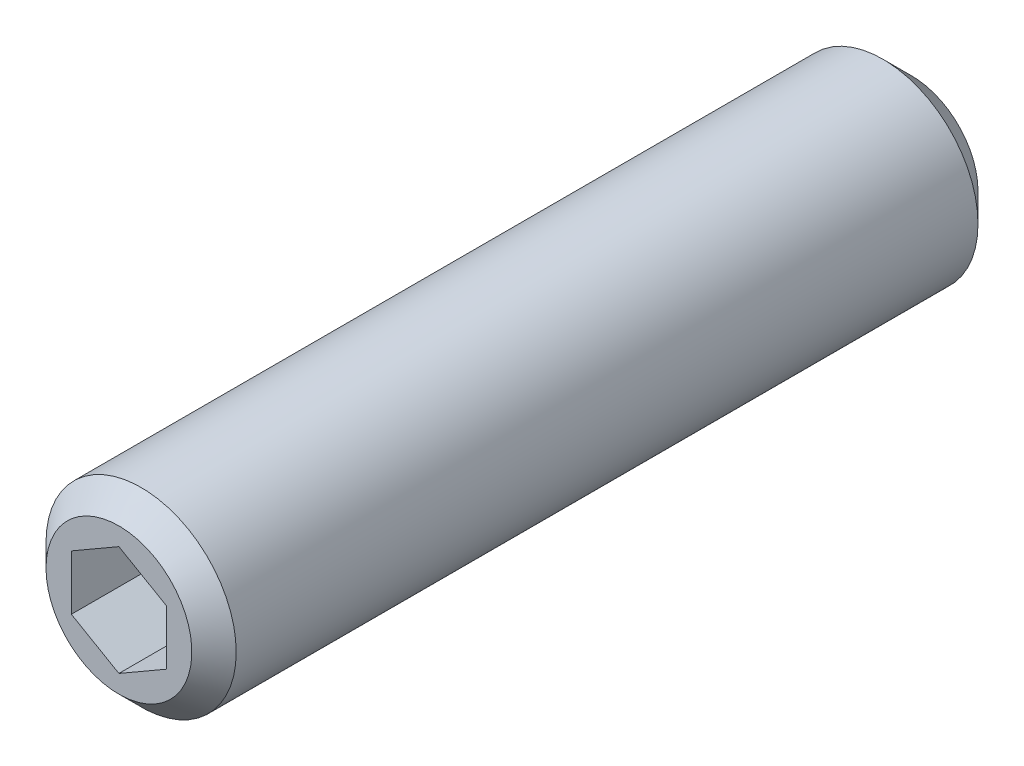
ISO-10303-21;
HEADER;
FILE_DESCRIPTION(('STEP AP214'),'2;1');
FILE_NAME('part.step','',(''),(''),'','','');
FILE_SCHEMA(('AUTOMOTIVE_DESIGN { 1 0 10303 214 1 1 1 1 }'));
ENDSEC;
DATA;
#1=APPLICATION_CONTEXT('core data for automotive mechanical design processes');
#2=APPLICATION_PROTOCOL_DEFINITION('international standard','automotive_design',2000,#1);
#3=PRODUCT_CONTEXT('',#1,'mechanical');
#4=PRODUCT('Part','Part','',(#3));
#5=PRODUCT_RELATED_PRODUCT_CATEGORY('part','',(#4));
#6=PRODUCT_DEFINITION_FORMATION('','',#4);
#7=PRODUCT_DEFINITION_CONTEXT('part definition',#1,'design');
#8=PRODUCT_DEFINITION('design','',#6,#7);
#9=PRODUCT_DEFINITION_SHAPE('','',#8);
#10=(LENGTH_UNIT() NAMED_UNIT(*) SI_UNIT(.MILLI.,.METRE.));
#11=(NAMED_UNIT(*) PLANE_ANGLE_UNIT() SI_UNIT($,.RADIAN.));
#12=(NAMED_UNIT(*) SI_UNIT($,.STERADIAN.) SOLID_ANGLE_UNIT());
#13=UNCERTAINTY_MEASURE_WITH_UNIT(LENGTH_MEASURE(1.E-05),#10,'distance_accuracy_value','');
#14=(GEOMETRIC_REPRESENTATION_CONTEXT(3) GLOBAL_UNCERTAINTY_ASSIGNED_CONTEXT((#13)) GLOBAL_UNIT_ASSIGNED_CONTEXT((#10,
#11,#12)) REPRESENTATION_CONTEXT('',''));
#15=CARTESIAN_POINT('',(0.,0.,0.));
#16=DIRECTION('',(0.,0.,1.));
#17=DIRECTION('',(1.,0.,0.));
#18=AXIS2_PLACEMENT_3D('',#15,#16,#17);
#19=CARTESIAN_POINT('',(-0.740835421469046,-2.76483541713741,25.999999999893));
#20=DIRECTION('',(1.44336692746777E-10,0.,-1.));
#21=DIRECTION('',(-0.499999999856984,0.866025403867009,-7.21667802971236E-11));
#22=AXIS2_PLACEMENT_3D('',#19,#20,#21);
#23=PLANE('',#22);
#24=CARTESIAN_POINT('',(-3.75275401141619E-09,0.,26.));
#25=DIRECTION('',(1.44336692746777E-10,0.,-1.));
#26=DIRECTION('',(-1.,0.,-1.44336692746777E-10));
#27=AXIS2_PLACEMENT_3D('',#24,#25,#26);
#28=CIRCLE('',#27,2.3);
#29=CARTESIAN_POINT('',(-2.30000000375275,0.,25.999999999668));
#30=VERTEX_POINT('',#29);
#31=EDGE_CURVE('E23',#30,#30,#28,.F.);
#32=ORIENTED_EDGE('',*,*,#31,.T.);
#33=EDGE_LOOP('',(#32));
#34=FACE_BOUND('',#33,.T.);
#35=DIRECTION('',(-0.866025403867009,-0.499999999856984,-1.2500014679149E-10));
#36=VECTOR('',#35,1.);
#37=CARTESIAN_POINT('',(0.749999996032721,-1.29903810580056,26.0000000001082));
#38=LINE('',#37,#36);
#39=CARTESIAN_POINT('',(1.49999999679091,-0.86602540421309,26.0000000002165));
#40=VERTEX_POINT('',#39);
#41=CARTESIAN_POINT('',(-3.75275526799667E-09,-1.73205080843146,26.));
#42=VERTEX_POINT('',#41);
#43=EDGE_CURVE('E81',#40,#42,#38,.T.);
#44=ORIENTED_EDGE('',*,*,#43,.T.);
#45=DIRECTION('',(-0.866025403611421,0.500000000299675,-1.24998338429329E-10));
#46=VECTOR('',#45,1.);
#47=CARTESIAN_POINT('',(-0.750000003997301,-1.29903810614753,25.9999999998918));
#48=LINE('',#47,#46);
#49=CARTESIAN_POINT('',(-1.5000000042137,-0.866025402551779,25.9999999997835));
#50=VERTEX_POINT('',#49);
#51=EDGE_CURVE('E110',#42,#50,#48,.T.);
#52=ORIENTED_EDGE('',*,*,#51,.T.);
#53=DIRECTION('',(-1.57536761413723E-11,1.,0.));
#54=VECTOR('',#53,1.);
#55=CARTESIAN_POINT('',(-1.50000000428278,5.19005411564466E-10,25.9999999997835));
#56=LINE('',#55,#54);
#57=CARTESIAN_POINT('',(-1.5000000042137,0.866025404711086,25.9999999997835));
#58=VERTEX_POINT('',#57);
#59=EDGE_CURVE('E31',#50,#58,#56,.T.);
#60=ORIENTED_EDGE('',*,*,#59,.T.);
#61=DIRECTION('',(0.866025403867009,0.499999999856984,1.2500014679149E-10));
#62=VECTOR('',#61,1.);
#63=CARTESIAN_POINT('',(-0.750000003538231,1.29903810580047,25.9999999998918));
#64=LINE('',#63,#62);
#65=CARTESIAN_POINT('',(-3.75275364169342E-09,1.73205080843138,26.));
#66=VERTEX_POINT('',#65);
#67=EDGE_CURVE('E116',#58,#66,#64,.T.);
#68=ORIENTED_EDGE('',*,*,#67,.T.);
#69=DIRECTION('',(0.866025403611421,-0.500000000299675,1.24998338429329E-10));
#70=VECTOR('',#69,1.);
#71=CARTESIAN_POINT('',(0.749999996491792,1.29903810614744,26.0000000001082));
#72=LINE('',#71,#70);
#73=CARTESIAN_POINT('',(1.49999999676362,0.866025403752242,26.0000000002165));
#74=VERTEX_POINT('',#73);
#75=EDGE_CURVE('E75',#66,#74,#72,.T.);
#76=ORIENTED_EDGE('',*,*,#75,.T.);
#77=DIRECTION('',(1.57536761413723E-11,-1.,0.));
#78=VECTOR('',#77,1.);
#79=CARTESIAN_POINT('',(1.49999999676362,0.866025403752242,26.0000000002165));
#80=LINE('',#79,#78);
#81=EDGE_CURVE('E93',#40,#74,#80,.F.);
#82=ORIENTED_EDGE('',*,*,#81,.F.);
#83=EDGE_LOOP('',(#44,#52,#60,#68,#76,#82));
#84=FACE_BOUND('',#83,.T.);
#85=ADVANCED_FACE('F14',(#34,#84),#23,.F.);
#86=CARTESIAN_POINT('',(-1.50000000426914,-0.866025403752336,25.9999999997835));
#87=DIRECTION('',(-1.,-1.57536761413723E-11,-1.44336692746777E-10));
#88=DIRECTION('',(-1.57536761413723E-11,1.,0.));
#89=AXIS2_PLACEMENT_3D('',#86,#87,#88);
#90=PLANE('',#89);
#91=DIRECTION('',(1.57536761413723E-11,-1.,0.));
#92=VECTOR('',#91,1.);
#93=CARTESIAN_POINT('',(-1.50000000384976,5.19010290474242E-10,22.9999999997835));
#94=LINE('',#93,#92);
#95=CARTESIAN_POINT('',(-1.50000000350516,0.86602540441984,22.9999999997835));
#96=VERTEX_POINT('',#95);
#97=CARTESIAN_POINT('',(-1.50000000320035,-0.866025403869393,22.9999999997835));
#98=VERTEX_POINT('',#97);
#99=EDGE_CURVE('E108',#96,#98,#94,.T.);
#100=ORIENTED_EDGE('',*,*,#99,.F.);
#101=DIRECTION('',(-1.44336692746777E-10,0.,1.));
#102=VECTOR('',#101,1.);
#103=CARTESIAN_POINT('',(-1.50000000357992,0.866025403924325,24.4999999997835));
#104=LINE('',#103,#102);
#105=EDGE_CURVE('E88',#96,#58,#104,.T.);
#106=ORIENTED_EDGE('',*,*,#105,.T.);
#107=ORIENTED_EDGE('',*,*,#59,.F.);
#108=DIRECTION('',(1.44336692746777E-10,0.,-1.));
#109=VECTOR('',#108,1.);
#110=CARTESIAN_POINT('',(-1.50000000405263,-0.866025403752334,24.4999999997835));
#111=LINE('',#110,#109);
#112=EDGE_CURVE('E112',#50,#98,#111,.T.);
#113=ORIENTED_EDGE('',*,*,#112,.T.);
#114=EDGE_LOOP('',(#100,#106,#107,#113));
#115=FACE_BOUND('',#114,.T.);
#116=ADVANCED_FACE('F145',(#115),#90,.F.);
#117=CARTESIAN_POINT('',(-3.72546795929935E-09,-1.73205080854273,26.));
#118=DIRECTION('',(-0.500000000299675,-0.866025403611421,-7.21699124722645E-11));
#119=DIRECTION('',(-0.866025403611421,0.500000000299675,-1.24998338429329E-10));
#120=AXIS2_PLACEMENT_3D('',#117,#118,#119);
#121=PLANE('',#120);
#122=DIRECTION('',(0.866025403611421,-0.500000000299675,1.24998338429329E-10));
#123=VECTOR('',#122,1.);
#124=CARTESIAN_POINT('',(-0.750000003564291,-1.29903810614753,22.9999999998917));
#125=LINE('',#124,#123);
#126=CARTESIAN_POINT('',(-3.43420430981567E-09,-1.73205080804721,23.));
#127=VERTEX_POINT('',#126);
#128=EDGE_CURVE('E114',#98,#127,#125,.T.);
#129=ORIENTED_EDGE('',*,*,#128,.F.);
#130=ORIENTED_EDGE('',*,*,#112,.F.);
#131=ORIENTED_EDGE('',*,*,#51,.F.);
#132=DIRECTION('',(1.44336692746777E-10,0.,-1.));
#133=VECTOR('',#132,1.);
#134=CARTESIAN_POINT('',(-4.00896167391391E-09,-1.7320508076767,24.5));
#135=LINE('',#134,#133);
#136=EDGE_CURVE('E86',#42,#127,#135,.T.);
#137=ORIENTED_EDGE('',*,*,#136,.T.);
#138=EDGE_LOOP('',(#129,#130,#131,#137));
#139=FACE_BOUND('',#138,.T.);
#140=ADVANCED_FACE('F150',(#139),#121,.F.);
#141=CARTESIAN_POINT('',(-1.50000000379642,0.866025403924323,25.9999999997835));
#142=DIRECTION('',(-0.499999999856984,0.866025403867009,-7.21667802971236E-11));
#143=DIRECTION('',(0.866025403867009,0.499999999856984,1.2500014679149E-10));
#144=AXIS2_PLACEMENT_3D('',#141,#142,#143);
#145=PLANE('',#144);
#146=DIRECTION('',(0.866025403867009,0.499999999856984,1.2500014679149E-10));
#147=VECTOR('',#146,1.);
#148=CARTESIAN_POINT('',(-0.75000000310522,1.29903810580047,22.9999999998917));
#149=LINE('',#148,#147);
#150=CARTESIAN_POINT('',(-3.188536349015E-09,1.73205080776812,23.));
#151=VERTEX_POINT('',#150);
#152=EDGE_CURVE('E104',#96,#151,#149,.T.);
#153=ORIENTED_EDGE('',*,*,#152,.T.);
#154=DIRECTION('',(-1.44336692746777E-10,0.,1.));
#155=VECTOR('',#154,1.);
#156=CARTESIAN_POINT('',(-3.56353542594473E-09,1.73205080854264,24.5));
#157=LINE('',#156,#155);
#158=EDGE_CURVE('E95',#151,#66,#157,.T.);
#159=ORIENTED_EDGE('',*,*,#158,.T.);
#160=ORIENTED_EDGE('',*,*,#67,.F.);
#161=ORIENTED_EDGE('',*,*,#105,.F.);
#162=EDGE_LOOP('',(#153,#159,#160,#161));
#163=FACE_BOUND('',#162,.T.);
#164=ADVANCED_FACE('F171',(#163),#145,.F.);
#165=CARTESIAN_POINT('',(1.49999999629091,-0.866025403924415,26.0000000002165));
#166=DIRECTION('',(0.499999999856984,-0.866025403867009,7.21667802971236E-11));
#167=DIRECTION('',(-0.866025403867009,-0.499999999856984,-1.2500014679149E-10));
#168=AXIS2_PLACEMENT_3D('',#165,#166,#167);
#169=PLANE('',#168);
#170=DIRECTION('',(-0.866025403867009,-0.499999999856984,-1.2500014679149E-10));
#171=VECTOR('',#170,1.);
#172=CARTESIAN_POINT('',(0.749999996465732,-1.29903810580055,23.0000000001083));
#173=LINE('',#172,#171);
#174=CARTESIAN_POINT('',(1.49999999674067,-0.866025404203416,23.0000000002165));
#175=VERTEX_POINT('',#174);
#176=EDGE_CURVE('E61',#175,#127,#173,.T.);
#177=ORIENTED_EDGE('',*,*,#176,.T.);
#178=ORIENTED_EDGE('',*,*,#136,.F.);
#179=ORIENTED_EDGE('',*,*,#43,.F.);
#180=DIRECTION('',(1.44336692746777E-10,0.,-1.));
#181=VECTOR('',#180,1.);
#182=CARTESIAN_POINT('',(1.49999999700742,-0.86602540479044,24.5000000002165));
#183=LINE('',#182,#181);
#184=EDGE_CURVE('E84',#40,#175,#183,.T.);
#185=ORIENTED_EDGE('',*,*,#184,.T.);
#186=EDGE_LOOP('',(#177,#178,#179,#185));
#187=FACE_BOUND('',#186,.T.);
#188=ADVANCED_FACE('F83',(#187),#169,.F.);
#189=CARTESIAN_POINT('',(-0.750000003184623,-2.16506350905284,22.9999999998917));
#190=DIRECTION('',(1.44336692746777E-10,0.,-1.));
#191=DIRECTION('',(-0.499999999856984,0.866025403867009,-7.21667802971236E-11));
#192=AXIS2_PLACEMENT_3D('',#189,#190,#191);
#193=PLANE('',#192);
#194=ORIENTED_EDGE('',*,*,#152,.F.);
#195=ORIENTED_EDGE('',*,*,#99,.T.);
#196=ORIENTED_EDGE('',*,*,#128,.T.);
#197=ORIENTED_EDGE('',*,*,#176,.F.);
#198=DIRECTION('',(-1.57536761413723E-11,1.,0.));
#199=VECTOR('',#198,1.);
#200=CARTESIAN_POINT('',(1.49999999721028,-5.19094966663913E-10,23.0000000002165));
#201=LINE('',#200,#199);
#202=CARTESIAN_POINT('',(1.49999999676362,0.866025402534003,23.0000000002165));
#203=VERTEX_POINT('',#202);
#204=EDGE_CURVE('E94',#175,#203,#201,.T.);
#205=ORIENTED_EDGE('',*,*,#204,.T.);
#206=DIRECTION('',(-0.866025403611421,0.500000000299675,-1.24998338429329E-10));
#207=VECTOR('',#206,1.);
#208=CARTESIAN_POINT('',(0.749999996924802,1.29903810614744,23.0000000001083));
#209=LINE('',#208,#207);
#210=EDGE_CURVE('E69',#203,#151,#209,.T.);
#211=ORIENTED_EDGE('',*,*,#210,.T.);
#212=EDGE_LOOP('',(#194,#195,#196,#197,#205,#211));
#213=FACE_BOUND('',#212,.T.);
#214=ADVANCED_FACE('F164',(#213),#193,.F.);
#215=CARTESIAN_POINT('',(-3.78004073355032E-09,1.73205080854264,26.));
#216=DIRECTION('',(0.500000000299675,0.866025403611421,7.21699124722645E-11));
#217=DIRECTION('',(0.866025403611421,-0.500000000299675,1.24998338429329E-10));
#218=AXIS2_PLACEMENT_3D('',#215,#216,#217);
#219=PLANE('',#218);
#220=ORIENTED_EDGE('',*,*,#210,.F.);
#221=DIRECTION('',(-1.44336692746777E-10,0.,1.));
#222=VECTOR('',#221,1.);
#223=CARTESIAN_POINT('',(1.49999999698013,0.866025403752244,24.5000000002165));
#224=LINE('',#223,#222);
#225=EDGE_CURVE('E97',#203,#74,#224,.T.);
#226=ORIENTED_EDGE('',*,*,#225,.T.);
#227=ORIENTED_EDGE('',*,*,#75,.F.);
#228=ORIENTED_EDGE('',*,*,#158,.F.);
#229=EDGE_LOOP('',(#220,#226,#227,#228));
#230=FACE_BOUND('',#229,.T.);
#231=ADVANCED_FACE('F156',(#230),#219,.F.);
#232=CARTESIAN_POINT('',(1.49999999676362,0.866025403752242,26.0000000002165));
#233=DIRECTION('',(1.,1.57536761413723E-11,1.44336692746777E-10));
#234=DIRECTION('',(1.57536761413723E-11,-1.,0.));
#235=AXIS2_PLACEMENT_3D('',#232,#233,#234);
#236=PLANE('',#235);
#237=ORIENTED_EDGE('',*,*,#204,.F.);
#238=ORIENTED_EDGE('',*,*,#184,.F.);
#239=ORIENTED_EDGE('',*,*,#81,.T.);
#240=ORIENTED_EDGE('',*,*,#225,.F.);
#241=EDGE_LOOP('',(#237,#238,#239,#240));
#242=FACE_BOUND('',#241,.T.);
#243=ADVANCED_FACE('F92',(#242),#236,.F.);
#244=CARTESIAN_POINT('',(-1.44336692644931E-10,0.,0.999999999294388));
#245=DIRECTION('',(-1.44336692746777E-10,0.,1.));
#246=DIRECTION('',(1.,0.,1.44336692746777E-10));
#247=AXIS2_PLACEMENT_3D('',#244,#245,#246);
#248=CYLINDRICAL_SURFACE('',#247,3.);
#249=CARTESIAN_POINT('',(-3.65171832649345E-09,0.,25.3));
#250=DIRECTION('',(1.44336692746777E-10,0.,-1.));
#251=DIRECTION('',(-1.,0.,-1.44336692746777E-10));
#252=AXIS2_PLACEMENT_3D('',#249,#250,#251);
#253=CIRCLE('',#252,3.);
#254=CARTESIAN_POINT('',(-3.00000000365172,0.,25.299999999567));
#255=VERTEX_POINT('',#254);
#256=EDGE_CURVE('E9',#255,#255,#253,.T.);
#257=ORIENTED_EDGE('',*,*,#256,.T.);
#258=EDGE_LOOP('',(#257));
#259=FACE_BOUND('',#258,.T.);
#260=CARTESIAN_POINT('',(-2.74239716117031E-10,0.,1.8999999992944));
#261=DIRECTION('',(-1.44336692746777E-10,0.,1.));
#262=DIRECTION('',(1.,0.,1.44336692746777E-10));
#263=AXIS2_PLACEMENT_3D('',#260,#261,#262);
#264=CIRCLE('',#263,3.);
#265=CARTESIAN_POINT('',(2.99999999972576,0.,1.89999999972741));
#266=VERTEX_POINT('',#265);
#267=EDGE_CURVE('E107',#266,#266,#264,.T.);
#268=ORIENTED_EDGE('',*,*,#267,.T.);
#269=EDGE_LOOP('',(#268));
#270=FACE_BOUND('',#269,.T.);
#271=ADVANCED_FACE('F152',(#259,#270),#248,.T.);
#272=CARTESIAN_POINT('',(-2.90307718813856,0.777877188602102,0.999999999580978));
#273=DIRECTION('',(-1.44336692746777E-10,0.,1.));
#274=DIRECTION('',(0.499999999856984,-0.866025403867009,7.21667802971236E-11));
#275=AXIS2_PLACEMENT_3D('',#272,#273,#274);
#276=PLANE('',#275);
#277=CARTESIAN_POINT('',(-1.44336692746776E-10,0.,1.));
#278=DIRECTION('',(-1.44336692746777E-10,0.,1.));
#279=DIRECTION('',(1.,0.,1.44336692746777E-10));
#280=AXIS2_PLACEMENT_3D('',#277,#278,#279);
#281=CIRCLE('',#280,2.1000000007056);
#282=CARTESIAN_POINT('',(2.10000000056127,0.,1.00000000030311));
#283=VERTEX_POINT('',#282);
#284=EDGE_CURVE('E128',#283,#283,#281,.F.);
#285=ORIENTED_EDGE('',*,*,#284,.T.);
#286=EDGE_LOOP('',(#285));
#287=FACE_BOUND('',#286,.T.);
#288=CARTESIAN_POINT('',(1.08253115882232E-10,0.,1.));
#289=DIRECTION('',(-1.44336692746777E-10,0.,1.));
#290=DIRECTION('',(1.,0.,1.44336692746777E-10));
#291=AXIS2_PLACEMENT_3D('',#288,#289,#290);
#292=CIRCLE('',#291,1.58113883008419);
#293=CARTESIAN_POINT('',(1.58113883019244,0.,1.00000000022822));
#294=VERTEX_POINT('',#293);
#295=EDGE_CURVE('E98',#294,#294,#292,.T.);
#296=ORIENTED_EDGE('',*,*,#295,.T.);
#297=EDGE_LOOP('',(#296));
#298=FACE_BOUND('',#297,.T.);
#299=ADVANCED_FACE('F161',(#287,#298),#276,.F.);
#300=CARTESIAN_POINT('',(0.,0.,1.75));
#301=DIRECTION('',(0.,0.,-1.));
#302=DIRECTION('',(-1.,0.,0.));
#303=AXIS2_PLACEMENT_3D('',#300,#301,#302);
#304=SPHERICAL_SURFACE('',#303,1.75);
#305=ORIENTED_EDGE('',*,*,#295,.F.);
#306=EDGE_LOOP('',(#305));
#307=FACE_BOUND('',#306,.T.);
#308=ADVANCED_FACE('F141',(#307),#304,.T.);
#309=CARTESIAN_POINT('',(-2.74239716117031E-10,0.,1.8999999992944));
#310=DIRECTION('',(-1.44336692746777E-10,0.,1.));
#311=DIRECTION('',(1.,0.,1.44336692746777E-10));
#312=AXIS2_PLACEMENT_3D('',#309,#310,#311);
#313=CONICAL_SURFACE('',#312,3.,0.785398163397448);
#314=ORIENTED_EDGE('',*,*,#284,.F.);
#315=EDGE_LOOP('',(#314));
#316=FACE_BOUND('',#315,.T.);
#317=ORIENTED_EDGE('',*,*,#267,.F.);
#318=EDGE_LOOP('',(#317));
#319=FACE_BOUND('',#318,.T.);
#320=ADVANCED_FACE('F135',(#316,#319),#313,.T.);
#321=CARTESIAN_POINT('',(-3.75275401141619E-09,0.,26.));
#322=DIRECTION('',(1.44336692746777E-10,0.,-1.));
#323=DIRECTION('',(-1.,0.,-1.44336692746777E-10));
#324=AXIS2_PLACEMENT_3D('',#321,#322,#323);
#325=CONICAL_SURFACE('',#324,2.3,0.785398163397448);
#326=ORIENTED_EDGE('',*,*,#256,.F.);
#327=EDGE_LOOP('',(#326));
#328=FACE_BOUND('',#327,.T.);
#329=ORIENTED_EDGE('',*,*,#31,.F.);
#330=EDGE_LOOP('',(#329));
#331=FACE_BOUND('',#330,.T.);
#332=ADVANCED_FACE('F16',(#328,#331),#325,.T.);
#333=CLOSED_SHELL('',(#85,#116,#140,#164,#188,#214,#231,#243,#271,#299,#308,#320,#332));
#334=MANIFOLD_SOLID_BREP('B1',#333);
#335=ADVANCED_BREP_SHAPE_REPRESENTATION('',(#18,#334),#14);
#336=SHAPE_DEFINITION_REPRESENTATION(#9,#335);
ENDSEC;
END-ISO-10303-21;
